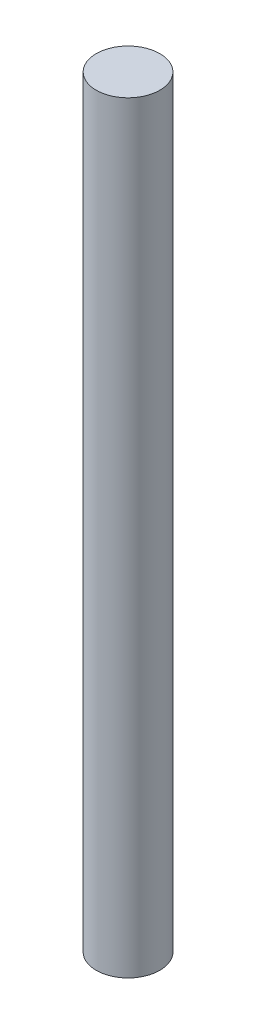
from build123d import *

# Parameters (mm, degrees)
SCHIZZO1_W = 1.5
SCHIZZO1_H = 36


with BuildPart() as part:
    # Schizzo1 → Rivoluzione1 (revolve)
    with BuildSketch(Plane.XY, mode=Mode.PRIVATE) as rivoluzione1_sk:
        with Locations((0.75, 38.989882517)):
            Rectangle(SCHIZZO1_W, SCHIZZO1_H)
    revolve(rivoluzione1_sk.sketch.rotate(Axis((0, 0, 0), (0, 1, 0)), 90), axis=Axis((0, 0, 0), (0, 1, 0)))


solid = part.part
